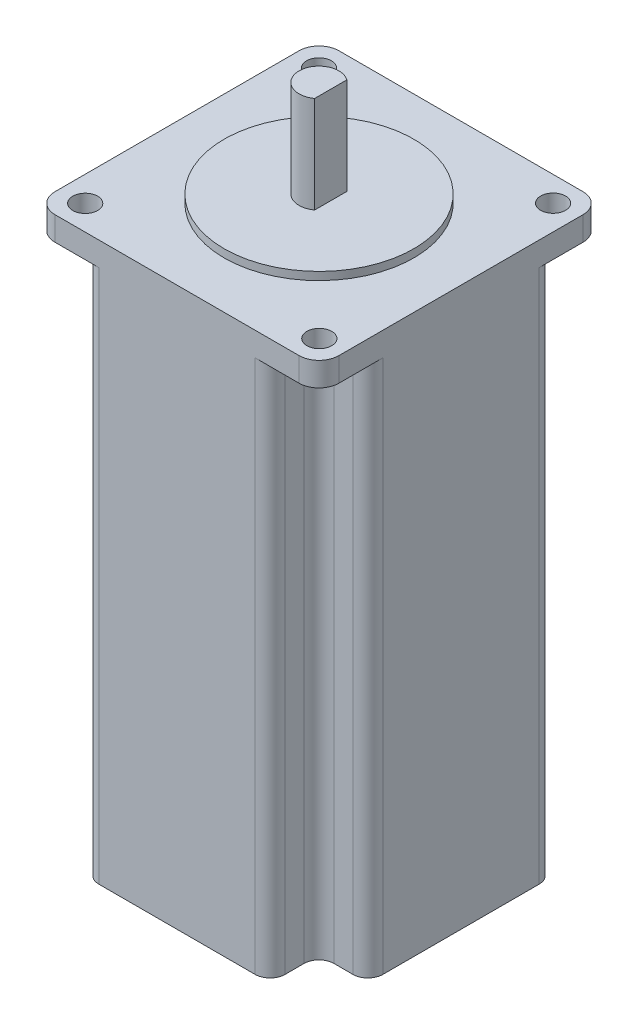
from build123d import *

# Parameters (mm, degrees)
BOSS_EXTRUDE1_DEPTH  = 112
SKETCH2_R            = 19.05
BOSS_EXTRUDE2_DEPTH  = 1.6
SKETCH3_R            = 4
BOSS_EXTRUDE3_DEPTH  = 19.4
SKETCH4_W            = 7.896046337
SKETCH4_H            = 7.324948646
CUT_EXTRUDE1_DEPTH   = 19.4
CUT_EXTRUDE2_DEPTH   = 107.2
MIRROR2_COPY_1_DEPTH = 107.2
FILLET1_R            = 3
SKETCH6_R            = 2.5
CUT_EXTRUDE3_DEPTH   = 107.2


with BuildPart() as part:
    # Sketch1 → Boss-Extrude1 (new body)
    with BuildSketch(Plane(origin=(0, 0, 0), x_dir=(1, 0, 0), z_dir=(0, 1, 0))):
        with BuildLine():
            Line((-24.5, -28.5), (24.5, -28.5))
            ThreePointArc((24.5, -28.5), (27.328427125, -27.328427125), (28.5, -24.5))
            Line((28.5, -24.5), (28.5, 24.5))
            ThreePointArc((28.5, 24.5), (27.328427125, 27.328427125), (24.5, 28.5))
            Line((24.5, 28.5), (-24.5, 28.5))
            ThreePointArc((-24.5, 28.5), (-27.328427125, 27.328427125), (-28.5, 24.5))
            Line((-28.5, 24.5), (-28.5, -24.5))
            ThreePointArc((-28.5, -24.5), (-27.328427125, -27.328427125), (-24.5, -28.5))
        make_face()
    extrude(amount=BOSS_EXTRUDE1_DEPTH)

    # Sketch2 → Boss-Extrude2 (add)
    with BuildSketch(Plane(origin=(0, 112, 0), x_dir=(1, 0, 0), z_dir=(0, 1, 0))):
        with Locations(Location((0, 0, 0), (0, 0, 270))):
            Circle(SKETCH2_R)
    extrude(amount=BOSS_EXTRUDE2_DEPTH)

    # Sketch3 → Boss-Extrude3 (add)
    with BuildSketch(Plane(origin=(0, 113.6, 0), x_dir=(1, 0, 0), z_dir=(0, 1, 0))):
        with Locations(Location((0, 0, 0), (0, 0, 270))):
            Circle(SKETCH3_R)
    extrude(amount=BOSS_EXTRUDE3_DEPTH)

    # Sketch4 → Cut-Extrude1 (cut)
    with BuildSketch(Plane(origin=(0, 133, 0), x_dir=(1, 0, 0), z_dir=(0, 1, 0))):
        with Locations((6.304367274, 0.076945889)):
            Rectangle(SKETCH4_W, SKETCH4_H)
    extrude(amount=-CUT_EXTRUDE1_DEPTH, mode=Mode.SUBTRACT)

    # Sketch5 → Cut-Extrude2 (cut)
    with BuildSketch(Plane.XZ):
        with BuildLine():
            Line((-28.5, 24.5), (-28.5, 18.683107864))
            Line((-28.5, 18.683107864), (-18.683107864, 18.683107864))
            Line((-18.683107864, 18.683107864), (-18.683107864, 28.5))
            Line((-18.683107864, 28.5), (-24.5, 28.5))
            ThreePointArc((-24.5, 28.5), (-27.328427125, 27.328427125), (-28.5, 24.5))
        make_face()
    cut_extrude2 = extrude(amount=-CUT_EXTRUDE2_DEPTH, mode=Mode.SUBTRACT)

    # Mirror1: Cut-Extrude2 across plane
    add(cut_extrude2.mirror(Plane(origin=(0, 0, 0), x_dir=(0, 0, 1), z_dir=(1, 0, 0))), mode=Mode.SUBTRACT)

    # Mirror2: Cut-Extrude2 across plane
    add(cut_extrude2.mirror(Plane.XY), mode=Mode.SUBTRACT)

    # Mirror2 copy 1 sketch → Mirror2 copy 1 (cut)
    with BuildSketch(Plane(origin=(0, 0, 0), x_dir=(-1, 0, 0), z_dir=(0, -1, 0))):
        with BuildLine():
            Line((-28.5, 24.5), (-28.5, 18.683107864))
            Line((-28.5, 18.683107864), (-18.683107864, 18.683107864))
            Line((-18.683107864, 18.683107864), (-18.683107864, 28.5))
            Line((-18.683107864, 28.5), (-24.5, 28.5))
            ThreePointArc((-24.5, 28.5), (-27.328427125, 27.328427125), (-28.5, 24.5))
        make_face()
    extrude(amount=-MIRROR2_COPY_1_DEPTH, mode=Mode.SUBTRACT)

    # Fillet1
    fillet1_edges = [part.edges().sort_by_distance(p)[0] for p in [
        (-18.683107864, 53.6, -18.683107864),
        (-18.683107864, 53.6, -28.5),
        (-28.5, 53.6, -18.683107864),
        (-18.683107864, 53.6, 28.5),
        (-18.683107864, 53.6, 18.683107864),
        (-28.5, 53.6, 18.683107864),
        (18.683107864, 53.6, 18.683107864),
        (18.683107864, 53.6, 28.5),
        (28.5, 53.6, 18.683107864),
        (18.683107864, 53.6, -28.5),
        (18.683107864, 53.6, -18.683107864),
        (28.5, 53.6, -18.683107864),
    ]]
    fillet(fillet1_edges, radius=FILLET1_R)

    # Sketch6 → Cut-Extrude3 (cut)
    with BuildSketch(Plane(origin=(0, 112, 0), x_dir=(1, 0, 0), z_dir=(0, 1, 0))):
        with Locations(Location((23.5, 23.5, 0), (0, 0, 270))):
            Circle(SKETCH6_R)
        with Locations(Location((23.564387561, -23.499955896, 0), (0, 0, 270))):
            Circle(SKETCH6_R)
        with Locations(Location((-23.5, 23.5, 0), (0, 0, 270))):
            Circle(SKETCH6_R)
        with Locations(Location((-23.435612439, -23.5, 0), (0, 0, 270))):
            Circle(SKETCH6_R)
    extrude(amount=-CUT_EXTRUDE3_DEPTH, mode=Mode.SUBTRACT)


solid = part.part
